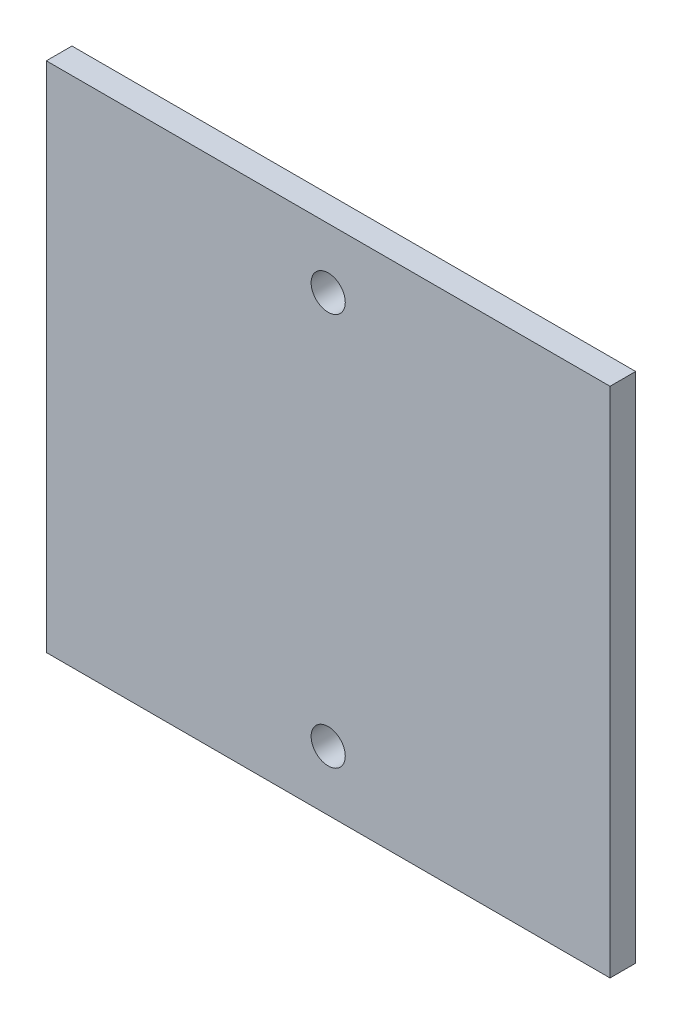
ISO-10303-21;
HEADER;
FILE_DESCRIPTION(('STEP AP214'),'2;1');
FILE_NAME('part.step','',(''),(''),'','','');
FILE_SCHEMA(('AUTOMOTIVE_DESIGN { 1 0 10303 214 1 1 1 1 }'));
ENDSEC;
DATA;
#1=APPLICATION_CONTEXT('core data for automotive mechanical design processes');
#2=APPLICATION_PROTOCOL_DEFINITION('international standard','automotive_design',2000,#1);
#3=PRODUCT_CONTEXT('',#1,'mechanical');
#4=PRODUCT('Part','Part','',(#3));
#5=PRODUCT_RELATED_PRODUCT_CATEGORY('part','',(#4));
#6=PRODUCT_DEFINITION_FORMATION('','',#4);
#7=PRODUCT_DEFINITION_CONTEXT('part definition',#1,'design');
#8=PRODUCT_DEFINITION('design','',#6,#7);
#9=PRODUCT_DEFINITION_SHAPE('','',#8);
#10=(LENGTH_UNIT() NAMED_UNIT(*) SI_UNIT(.MILLI.,.METRE.));
#11=(NAMED_UNIT(*) PLANE_ANGLE_UNIT() SI_UNIT($,.RADIAN.));
#12=(NAMED_UNIT(*) SI_UNIT($,.STERADIAN.) SOLID_ANGLE_UNIT());
#13=UNCERTAINTY_MEASURE_WITH_UNIT(LENGTH_MEASURE(1.E-05),#10,'distance_accuracy_value','');
#14=(GEOMETRIC_REPRESENTATION_CONTEXT(3) GLOBAL_UNCERTAINTY_ASSIGNED_CONTEXT((#13)) GLOBAL_UNIT_ASSIGNED_CONTEXT((#10,
#11,#12)) REPRESENTATION_CONTEXT('',''));
#15=CARTESIAN_POINT('',(0.,0.,0.));
#16=DIRECTION('',(0.,0.,1.));
#17=DIRECTION('',(1.,0.,0.));
#18=AXIS2_PLACEMENT_3D('',#15,#16,#17);
#19=CARTESIAN_POINT('',(165.,-150.,15.));
#20=DIRECTION('',(-1.,0.,0.));
#21=DIRECTION('',(0.,0.,1.));
#22=AXIS2_PLACEMENT_3D('',#19,#20,#21);
#23=PLANE('',#22);
#24=DIRECTION('',(0.,1.,0.));
#25=VECTOR('',#24,1.);
#26=CARTESIAN_POINT('',(165.,-150.,0.));
#27=LINE('',#26,#25);
#28=CARTESIAN_POINT('',(165.,-150.,0.));
#29=VERTEX_POINT('',#28);
#30=CARTESIAN_POINT('',(165.,150.,0.));
#31=VERTEX_POINT('',#30);
#32=EDGE_CURVE('E119',#29,#31,#27,.T.);
#33=ORIENTED_EDGE('',*,*,#32,.T.);
#34=DIRECTION('',(0.,0.,-1.));
#35=VECTOR('',#34,1.);
#36=CARTESIAN_POINT('',(165.,150.,15.));
#37=LINE('',#36,#35);
#38=CARTESIAN_POINT('',(165.,150.,15.));
#39=VERTEX_POINT('',#38);
#40=EDGE_CURVE('E13',#39,#31,#37,.T.);
#41=ORIENTED_EDGE('',*,*,#40,.F.);
#42=DIRECTION('',(0.,1.,0.));
#43=VECTOR('',#42,1.);
#44=CARTESIAN_POINT('',(165.,-150.,15.));
#45=LINE('',#44,#43);
#46=CARTESIAN_POINT('',(165.,-150.,15.));
#47=VERTEX_POINT('',#46);
#48=EDGE_CURVE('E102',#47,#39,#45,.T.);
#49=ORIENTED_EDGE('',*,*,#48,.F.);
#50=DIRECTION('',(0.,0.,-1.));
#51=VECTOR('',#50,1.);
#52=CARTESIAN_POINT('',(165.,-150.,15.));
#53=LINE('',#52,#51);
#54=EDGE_CURVE('E115',#47,#29,#53,.T.);
#55=ORIENTED_EDGE('',*,*,#54,.T.);
#56=EDGE_LOOP('',(#33,#41,#49,#55));
#57=FACE_BOUND('',#56,.T.);
#58=ADVANCED_FACE('F50',(#57),#23,.F.);
#59=CARTESIAN_POINT('',(-165.,150.,15.));
#60=DIRECTION('',(0.,-1.,0.));
#61=DIRECTION('',(0.,0.,-1.));
#62=AXIS2_PLACEMENT_3D('',#59,#60,#61);
#63=PLANE('',#62);
#64=DIRECTION('',(-1.,0.,0.));
#65=VECTOR('',#64,1.);
#66=CARTESIAN_POINT('',(-165.,150.,0.));
#67=LINE('',#66,#65);
#68=CARTESIAN_POINT('',(-165.,150.,0.));
#69=VERTEX_POINT('',#68);
#70=EDGE_CURVE('E107',#31,#69,#67,.T.);
#71=ORIENTED_EDGE('',*,*,#70,.T.);
#72=DIRECTION('',(0.,0.,-1.));
#73=VECTOR('',#72,1.);
#74=CARTESIAN_POINT('',(-165.,150.,15.));
#75=LINE('',#74,#73);
#76=CARTESIAN_POINT('',(-165.,150.,15.));
#77=VERTEX_POINT('',#76);
#78=EDGE_CURVE('E59',#77,#69,#75,.T.);
#79=ORIENTED_EDGE('',*,*,#78,.F.);
#80=DIRECTION('',(-1.,0.,0.));
#81=VECTOR('',#80,1.);
#82=CARTESIAN_POINT('',(-165.,150.,15.));
#83=LINE('',#82,#81);
#84=EDGE_CURVE('E97',#39,#77,#83,.T.);
#85=ORIENTED_EDGE('',*,*,#84,.F.);
#86=ORIENTED_EDGE('',*,*,#40,.T.);
#87=EDGE_LOOP('',(#71,#79,#85,#86));
#88=FACE_BOUND('',#87,.T.);
#89=ADVANCED_FACE('F106',(#88),#63,.F.);
#90=CARTESIAN_POINT('',(-165.,-150.,15.));
#91=DIRECTION('',(1.,0.,0.));
#92=DIRECTION('',(0.,0.,-1.));
#93=AXIS2_PLACEMENT_3D('',#90,#91,#92);
#94=PLANE('',#93);
#95=DIRECTION('',(0.,-1.,0.));
#96=VECTOR('',#95,1.);
#97=CARTESIAN_POINT('',(-165.,-150.,0.));
#98=LINE('',#97,#96);
#99=CARTESIAN_POINT('',(-165.,-150.,0.));
#100=VERTEX_POINT('',#99);
#101=EDGE_CURVE('E84',#69,#100,#98,.T.);
#102=ORIENTED_EDGE('',*,*,#101,.T.);
#103=DIRECTION('',(0.,0.,-1.));
#104=VECTOR('',#103,1.);
#105=CARTESIAN_POINT('',(-165.,-150.,15.));
#106=LINE('',#105,#104);
#107=CARTESIAN_POINT('',(-165.,-150.,15.));
#108=VERTEX_POINT('',#107);
#109=EDGE_CURVE('E109',#108,#100,#106,.T.);
#110=ORIENTED_EDGE('',*,*,#109,.F.);
#111=DIRECTION('',(0.,-1.,0.));
#112=VECTOR('',#111,1.);
#113=CARTESIAN_POINT('',(-165.,-150.,15.));
#114=LINE('',#113,#112);
#115=EDGE_CURVE('E100',#77,#108,#114,.T.);
#116=ORIENTED_EDGE('',*,*,#115,.F.);
#117=ORIENTED_EDGE('',*,*,#78,.T.);
#118=EDGE_LOOP('',(#102,#110,#116,#117));
#119=FACE_BOUND('',#118,.T.);
#120=ADVANCED_FACE('F110',(#119),#94,.F.);
#121=CARTESIAN_POINT('',(-165.,-150.,15.));
#122=DIRECTION('',(0.,1.,0.));
#123=DIRECTION('',(0.,0.,1.));
#124=AXIS2_PLACEMENT_3D('',#121,#122,#123);
#125=PLANE('',#124);
#126=DIRECTION('',(1.,0.,0.));
#127=VECTOR('',#126,1.);
#128=CARTESIAN_POINT('',(-165.,-150.,0.));
#129=LINE('',#128,#127);
#130=EDGE_CURVE('E90',#100,#29,#129,.T.);
#131=ORIENTED_EDGE('',*,*,#130,.T.);
#132=ORIENTED_EDGE('',*,*,#54,.F.);
#133=DIRECTION('',(1.,0.,0.));
#134=VECTOR('',#133,1.);
#135=CARTESIAN_POINT('',(-165.,-150.,15.));
#136=LINE('',#135,#134);
#137=EDGE_CURVE('E67',#108,#47,#136,.T.);
#138=ORIENTED_EDGE('',*,*,#137,.F.);
#139=ORIENTED_EDGE('',*,*,#109,.T.);
#140=EDGE_LOOP('',(#131,#132,#138,#139));
#141=FACE_BOUND('',#140,.T.);
#142=ADVANCED_FACE('F134',(#141),#125,.F.);
#143=CARTESIAN_POINT('',(0.,0.,15.));
#144=DIRECTION('',(0.,0.,-1.));
#145=DIRECTION('',(-1.,0.,0.));
#146=AXIS2_PLACEMENT_3D('',#143,#144,#145);
#147=PLANE('',#146);
#148=CARTESIAN_POINT('',(0.,115.,15.));
#149=DIRECTION('',(0.,0.,1.));
#150=DIRECTION('',(1.,0.,0.));
#151=AXIS2_PLACEMENT_3D('',#148,#149,#150);
#152=CIRCLE('',#151,10.);
#153=CARTESIAN_POINT('',(10.,115.,15.));
#154=VERTEX_POINT('',#153);
#155=EDGE_CURVE('E150',#154,#154,#152,.T.);
#156=ORIENTED_EDGE('',*,*,#155,.F.);
#157=EDGE_LOOP('',(#156));
#158=FACE_BOUND('',#157,.T.);
#159=CARTESIAN_POINT('',(0.,-115.,15.));
#160=DIRECTION('',(0.,0.,1.));
#161=DIRECTION('',(1.,0.,0.));
#162=AXIS2_PLACEMENT_3D('',#159,#160,#161);
#163=CIRCLE('',#162,10.);
#164=CARTESIAN_POINT('',(10.,-115.,15.));
#165=VERTEX_POINT('',#164);
#166=EDGE_CURVE('E142',#165,#165,#163,.T.);
#167=ORIENTED_EDGE('',*,*,#166,.F.);
#168=EDGE_LOOP('',(#167));
#169=FACE_BOUND('',#168,.T.);
#170=ORIENTED_EDGE('',*,*,#48,.T.);
#171=ORIENTED_EDGE('',*,*,#84,.T.);
#172=ORIENTED_EDGE('',*,*,#115,.T.);
#173=ORIENTED_EDGE('',*,*,#137,.T.);
#174=EDGE_LOOP('',(#170,#171,#172,#173));
#175=FACE_BOUND('',#174,.T.);
#176=ADVANCED_FACE('F98',(#158,#169,#175),#147,.F.);
#177=CARTESIAN_POINT('',(0.,0.,0.));
#178=DIRECTION('',(0.,0.,-1.));
#179=DIRECTION('',(-1.,0.,0.));
#180=AXIS2_PLACEMENT_3D('',#177,#178,#179);
#181=PLANE('',#180);
#182=CARTESIAN_POINT('',(0.,115.,0.));
#183=DIRECTION('',(0.,0.,1.));
#184=DIRECTION('',(1.,0.,0.));
#185=AXIS2_PLACEMENT_3D('',#182,#183,#184);
#186=CIRCLE('',#185,10.);
#187=CARTESIAN_POINT('',(10.,115.,0.));
#188=VERTEX_POINT('',#187);
#189=EDGE_CURVE('E123',#188,#188,#186,.T.);
#190=ORIENTED_EDGE('',*,*,#189,.T.);
#191=EDGE_LOOP('',(#190));
#192=FACE_BOUND('',#191,.T.);
#193=CARTESIAN_POINT('',(0.,-115.,0.));
#194=DIRECTION('',(0.,0.,1.));
#195=DIRECTION('',(1.,0.,0.));
#196=AXIS2_PLACEMENT_3D('',#193,#194,#195);
#197=CIRCLE('',#196,10.);
#198=CARTESIAN_POINT('',(10.,-115.,0.));
#199=VERTEX_POINT('',#198);
#200=EDGE_CURVE('E146',#199,#199,#197,.T.);
#201=ORIENTED_EDGE('',*,*,#200,.T.);
#202=EDGE_LOOP('',(#201));
#203=FACE_BOUND('',#202,.T.);
#204=ORIENTED_EDGE('',*,*,#32,.F.);
#205=ORIENTED_EDGE('',*,*,#130,.F.);
#206=ORIENTED_EDGE('',*,*,#101,.F.);
#207=ORIENTED_EDGE('',*,*,#70,.F.);
#208=EDGE_LOOP('',(#204,#205,#206,#207));
#209=FACE_BOUND('',#208,.T.);
#210=ADVANCED_FACE('F137',(#192,#203,#209),#181,.T.);
#211=CARTESIAN_POINT('',(0.,-115.,0.));
#212=DIRECTION('',(0.,0.,1.));
#213=DIRECTION('',(1.,0.,0.));
#214=AXIS2_PLACEMENT_3D('',#211,#212,#213);
#215=CYLINDRICAL_SURFACE('',#214,10.);
#216=ORIENTED_EDGE('',*,*,#200,.F.);
#217=EDGE_LOOP('',(#216));
#218=FACE_BOUND('',#217,.T.);
#219=ORIENTED_EDGE('',*,*,#166,.T.);
#220=EDGE_LOOP('',(#219));
#221=FACE_BOUND('',#220,.T.);
#222=ADVANCED_FACE('F164',(#218,#221),#215,.F.);
#223=CARTESIAN_POINT('',(0.,115.,0.));
#224=DIRECTION('',(0.,0.,1.));
#225=DIRECTION('',(1.,0.,0.));
#226=AXIS2_PLACEMENT_3D('',#223,#224,#225);
#227=CYLINDRICAL_SURFACE('',#226,10.);
#228=ORIENTED_EDGE('',*,*,#189,.F.);
#229=EDGE_LOOP('',(#228));
#230=FACE_BOUND('',#229,.T.);
#231=ORIENTED_EDGE('',*,*,#155,.T.);
#232=EDGE_LOOP('',(#231));
#233=FACE_BOUND('',#232,.T.);
#234=ADVANCED_FACE('F161',(#230,#233),#227,.F.);
#235=CLOSED_SHELL('',(#58,#89,#120,#142,#176,#210,#222,#234));
#236=MANIFOLD_SOLID_BREP('B2',#235);
#237=ADVANCED_BREP_SHAPE_REPRESENTATION('',(#18,#236),#14);
#238=SHAPE_DEFINITION_REPRESENTATION(#9,#237);
ENDSEC;
END-ISO-10303-21;
